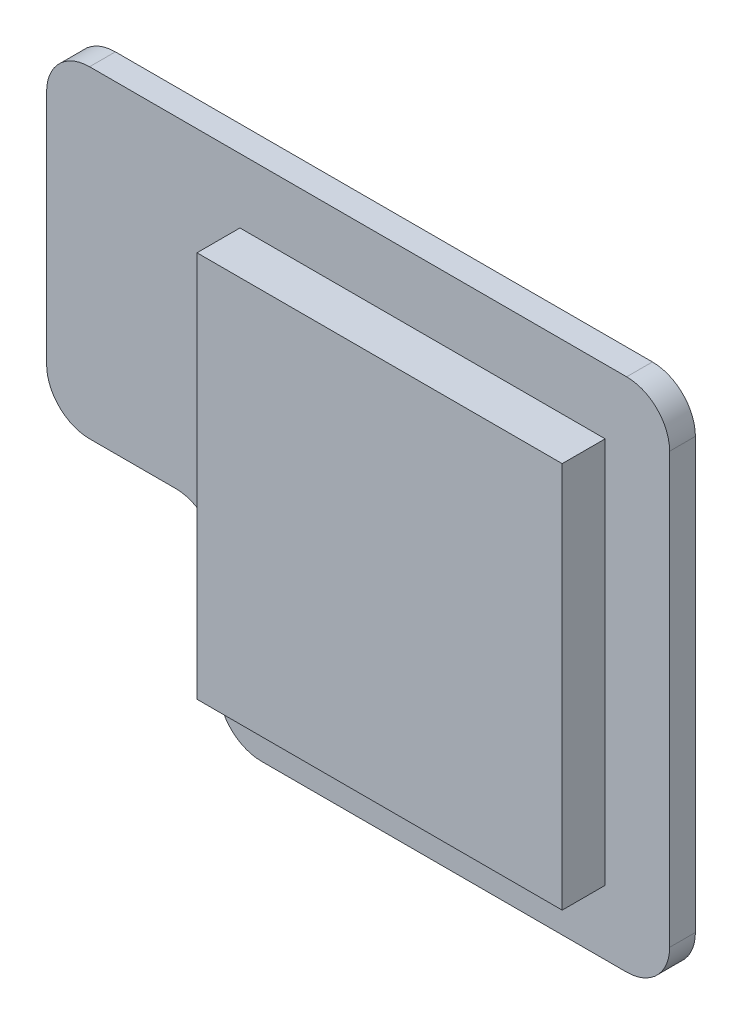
from build123d import *

# Parameters (mm, degrees)
EXTRUSION1_DEPTH = 6
CONG_1_R         = 10
ESQUISSE2_W      = 85
ESQUISSE2_H      = 90
EXTRUSION2_DEPTH = 10


with BuildPart() as part:
    # Esquisse1 → Extrusion1 (new body)
    with BuildSketch(Plane.XY):
        Polygon((-80, 95), (65, 95), (65, -25), (-40, -25), (-40, 20), (-80, 20), align=None)
    extrude(amount=EXTRUSION1_DEPTH)

    # Cong_1
    cong_1_edges = [part.edges().sort_by_distance(p)[0] for p in [
        (65, -25, 3),
        (-40, -25, 3),
        (-40, 20, 3),
        (-80, 20, 3),
        (-80, 95, 3),
        (65, 95, 3),
    ]]
    fillet(cong_1_edges, radius=CONG_1_R)

    # Esquisse2 → Extrusion2 (add)
    with BuildSketch(Plane.XY.offset(6)):
        with Locations((7.5, 35)):
            Rectangle(ESQUISSE2_W, ESQUISSE2_H)
    extrude(amount=EXTRUSION2_DEPTH)


solid = part.part
